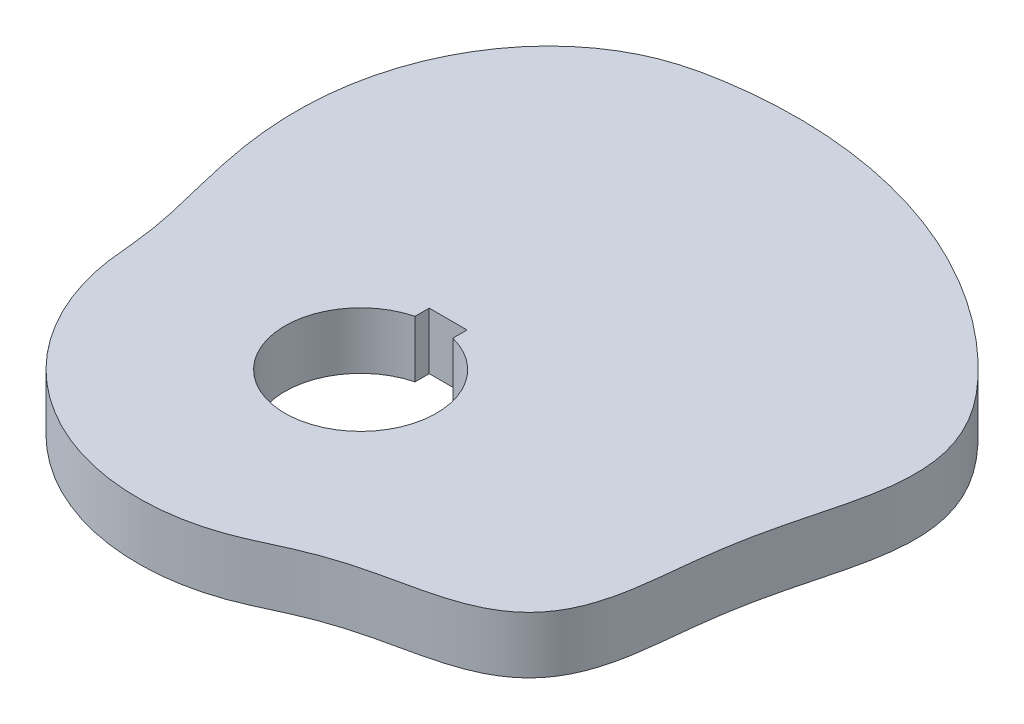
from build123d import *

# Parameters (mm, degrees)
SKETCH1_R                        = 177.8
SKETCH1_R_2                      = 25.4
DISC_CW_INSIDE_SWINGINGARM_DEPTH = 19.05
KEYWAY_0_5000_X_0_3750MM_DEPTH   = 253.167766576
SINGLE_SURFACE_SKETCH_R          = 177.8
SINGLE_SURFACE_DEPTH             = 20.6502


with BuildPart() as part:
    # Sketch1 → Disc_ CW_ Inside_ SwingingArm (new body)
    with BuildSketch(Plane(origin=(0, 0, 0), x_dir=(1, 0, 0), z_dir=(0, 1, 0))):
        with Locations(Location((0, 0, 0), (0, 0, 270))):
            Circle(SKETCH1_R)
        with Locations(Location((0, 0, 0), (0, 0, 270))):
            Circle(SKETCH1_R_2, mode=Mode.SUBTRACT)
    extrude(amount=-DISC_CW_INSIDE_SWINGINGARM_DEPTH)

    # Sketch7 → Keyway_ 0.5000 x 0.3750mm (cut, through all)
    with BuildSketch(Plane(origin=(0, 0, 0), x_dir=(1, 0, 0), z_dir=(0, 1, 0))):
        with BuildLine():
            Line((6.35, 24.593444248), (6.35, 29.355944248))
            Line((6.35, 29.355944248), (-6.35, 29.355944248))
            Line((-6.35, 29.355944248), (-6.35, 24.593444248))
            ThreePointArc((-6.35, 24.593444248), (0, -25.4), (6.35, 24.593444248))
        make_face()
    extrude(amount=-KEYWAY_0_5000_X_0_3750MM_DEPTH, mode=Mode.SUBTRACT)

    # Single Surface Sketch → Single Surface (cut)
    with BuildSketch(Plane(origin=(0, 0, 0), x_dir=(1, 0, 0), z_dir=(0, 1, 0))):
        Circle(SINGLE_SURFACE_SKETCH_R)
        with BuildLine():
            add(Edge.make_bspline(
                [(109.559698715, -17.138811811), (109.670945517, -16.427679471), (109.872598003, -15.051108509), (110.143805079, -12.990584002), (110.390757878, -10.94489769), (110.627231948, -8.85282623), (110.858890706, -6.717267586), (111.091589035, -4.541237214), (111.331217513, -2.327935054), (111.583527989, -0.080815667), (111.85394266, 2.196357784), (112.147354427, 4.499488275), (112.467929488, 6.824160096), (112.818926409, 9.165700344), (113.202547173, 11.519285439), (113.619834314, 13.880083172), (114.070623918, 16.243413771), (114.553557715, 18.604909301), (115.066150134, 20.960650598), (115.604899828, 23.307264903), (116.16543123, 25.641974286), (116.742650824, 27.962593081), (117.330904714, 30.26747994), (117.924127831, 32.555455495), (118.515979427, 34.825699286), (119.099963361, 37.077639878), (119.669534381, 39.310850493), (120.21819295, 41.524959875), (120.739571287, 43.71958518), (121.227512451, 45.894290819), (121.676143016, 48.048574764), (122.079938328, 50.181881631), (122.433777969, 52.293640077), (122.732988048, 54.383320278), (122.973366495, 56.450505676), (123.151187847, 58.494971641), (123.263185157, 60.5167624), (123.30650864, 62.516256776), (123.278663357, 64.49421329), (123.177431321, 66.451786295), (123.000786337, 68.390507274), (122.7468121, 70.312229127), (122.413634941, 72.219035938), (121.999381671, 74.113125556), (121.502170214, 75.996676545), (120.920136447, 77.871713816), (120.251495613, 79.739987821), (119.494631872, 81.602880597), (118.64820578, 83.461348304), (117.711267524, 85.315905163), (116.683363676, 87.166648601), (115.564626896, 89.013320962), (114.35584094, 90.855399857), (113.058476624, 92.692207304), (111.674698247, 94.523027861), (110.207341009, 96.347224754), (108.659869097, 98.164351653), (107.036298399, 99.974231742), (105.34117201, 101.777083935), (103.58041083, 103.572216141), (101.767548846, 105.353594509), (99.91466832, 107.112608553), (98.030056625, 108.840023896), (96.11561158, 110.534313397), (94.171881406, 112.194925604), (92.199467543, 113.821364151), (90.198968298, 115.413131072), (88.170993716, 116.969742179), (86.116161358, 118.490723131), (84.035097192, 119.975610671), (81.928435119, 121.423952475), (79.796816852, 122.835307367), (77.640891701, 124.209245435), (75.461316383, 125.545348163), (73.258754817, 126.843208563), (71.033877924, 128.102431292), (68.787363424, 129.322632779), (66.519895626, 130.50344134), (64.232165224, 131.644497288), (61.924869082, 132.745453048), (59.598710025, 133.805973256), (57.254396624, 134.825734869), (54.892642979, 135.804427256), (52.514168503, 136.7417523), (50.119697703, 137.637424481), (47.709959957, 138.49117097), (45.285689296, 139.302731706), (42.847624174, 140.071859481), (40.396507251, 140.79832001), (37.933085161, 141.481892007), (35.458108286, 142.122367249), (32.972330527, 142.719550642), (30.476509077, 143.273260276), (27.971404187, 143.783327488), (25.457778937, 144.249596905), (22.936399, 144.671926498), (20.408032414, 145.05018762), (17.873449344, 145.38426505), (15.333421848, 145.674057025), (12.788723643, 145.919475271), (10.240129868, 146.120445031), (7.688416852, 146.276905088), (5.134361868, 146.388807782), (2.578742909, 146.456119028), (0.022338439, 146.478818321), (-2.534072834, 146.456898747), (-5.089712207, 146.390366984), (-7.643801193, 146.27924329), (-10.195561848, 146.123561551), (-12.744216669, 145.923369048), (-15.288990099, 145.67872729), (-17.829104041, 145.389708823), (-20.279307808, 145.067518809), (-22.797558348, 144.693783), (-25.282232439, 144.28097168), (-27.799569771, 143.804871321), (-30.17828065, 143.294295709), (-32.505850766, 142.726979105), (-34.786796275, 142.096811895), (-37.026091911, 141.397982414), (-39.228907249, 140.625031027), (-41.400208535, 139.772696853), (-43.544901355, 138.836685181), (-45.66552443, 137.811466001), (-47.764431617, 136.697546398), (-49.839272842, 135.492553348), (-51.887057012, 134.197134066), (-53.904127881, 132.81181686), (-55.886830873, 131.33758377), (-57.831447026, 129.775684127), (-59.734248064, 128.127693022), (-61.591519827, 126.395499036), (-63.399595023, 124.581307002), (-65.154883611, 122.687632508), (-66.853903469, 120.717294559), (-68.493310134, 118.673404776), (-70.069925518, 116.559353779), (-71.580765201, 114.378794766), (-73.023064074, 112.135624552), (-74.394300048, 109.833962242), (-75.692215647, 107.478125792), (-76.914837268, 105.072606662), (-78.060491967, 102.622042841), (-79.12782163, 100.131190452), (-80.115794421, 97.604894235), (-81.023713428, 95.048057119), (-81.851222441, 92.46560919), (-82.598308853, 89.862476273), (-83.265303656, 87.24354841), (-83.852878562, 84.613648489), (-84.362040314, 81.977501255), (-84.794122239, 79.339702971), (-85.150773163, 76.704691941), (-85.433943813, 74.076720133), (-85.645870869, 71.459826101), (-85.789058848, 68.857809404), (-85.866260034, 66.274206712), (-85.880452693, 63.712269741), (-85.834817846, 61.174945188), (-85.732714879, 58.664856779), (-85.577656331, 56.184289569), (-85.373282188, 53.735176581), (-85.123334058, 51.31908792), (-84.831629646, 48.937222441), (-84.502037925, 46.590402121), (-84.138455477, 44.279069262), (-83.744784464, 42.003286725), (-83.324912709, 39.762741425), (-82.882696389, 37.556751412), (-82.421945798, 35.384276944), (-81.946414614, 33.243936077), (-81.459793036, 31.134025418), (-80.96570499, 29.052546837), (-80.467709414, 26.997241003), (-79.969305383, 24.965628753), (-79.473940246, 22.955061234), (-78.985020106, 20.962779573), (-78.505918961, 18.985984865), (-78.039991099, 17.021917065), (-77.590557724, 15.067946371), (-77.160960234, 13.121657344), (-76.754321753, 11.180985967), (-76.374322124, 9.244141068), (-76.022509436, 7.312321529), (-75.705537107, 5.390546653), (-75.423950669, 3.490016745), (-75.178344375, 1.624594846), (-74.966061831, -0.191206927), (-74.782210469, -1.94347786), (-74.620023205, -3.6197232), (-74.471732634, -5.20953816), (-74.329227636, -6.705008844), (-74.184947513, -8.105093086), (-74.027774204, -9.436269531), (-73.851009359, -10.730859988), (-73.652528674, -12.018109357), (-73.431553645, -13.301691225), (-73.188226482, -14.581223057), (-72.922601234, -15.856312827), (-72.634764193, -17.12657274), (-72.324801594, -18.391615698), (-71.992808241, -19.651056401), (-71.63888516, -20.904511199), (-71.263140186, -22.151598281), (-70.865687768, -23.391937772), (-70.446648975, -24.625151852), (-70.00615145, -25.850864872), (-69.544329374, -27.068703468), (-69.061323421, -28.278296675), (-68.55728072, -29.479276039), (-68.032354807, -30.67127573), (-67.48670558, -31.853932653), (-66.920499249, -33.02688656), (-66.333908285, -34.189780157), (-65.72711137, -35.342259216), (-65.10029334, -36.48397268), (-64.453645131, -37.614572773), (-63.787363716, -38.733715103), (-63.101652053, -39.841058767), (-62.396719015, -40.93626646), (-61.672779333, -42.019004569), (-60.930053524, -43.088943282), (-60.16876783, -44.145756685), (-59.389154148, -45.189122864), (-58.591449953, -46.218723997), (-57.775898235, -47.23424646), (-56.942747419, -48.235380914), (-56.09225129, -49.221822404), (-55.224668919, -50.193270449), (-54.340264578, -51.149429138), (-53.439307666, -52.090007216), (-52.522072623, -53.014718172), (-51.588838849, -53.923280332), (-50.639890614, -54.815416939), (-49.675516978, -55.690856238), (-48.696011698, -56.549331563), (-47.701673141, -57.390581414), (-46.692804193, -58.214349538), (-45.669712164, -59.020385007), (-44.632708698, -59.808442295), (-43.582109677, -60.578281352), (-42.518235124, -61.329667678), (-41.441409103, -62.062372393), (-40.351959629, -62.776172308), (-39.250218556, -63.470849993), (-38.136521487, -64.146193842), (-37.011207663, -64.801998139), (-35.874619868, -65.43806312), (-34.727104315, -66.054195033), (-33.56901055, -66.650206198), (-32.40069134, -67.225915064), (-31.222502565, -67.781146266), (-30.034803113, -68.315730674), (-28.837954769, -68.829505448), (-27.632322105, -69.322314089), (-26.418272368, -69.794006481), (-25.196175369, -70.244438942), (-23.966403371, -70.673474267), (-22.729330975, -71.080981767), (-21.485335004, -71.466837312), (-20.234794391, -71.830923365), (-18.978090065, -72.173129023), (-17.715604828, -72.493350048), (-16.447723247, -72.791488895), (-15.17483153, -73.06745475), (-13.897317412, -73.32116355), (-12.615570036, -73.552538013), (-11.329979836, -73.761507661), (-10.040938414, -73.948008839), (-8.748838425, -74.111984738), (-7.454073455, -74.253385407), (-6.157037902, -74.372167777), (-4.858126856, -74.468295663), (-3.557735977, -74.541739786), (-2.256261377, -74.592477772), (-0.954099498, -74.620494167), (0.348353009, -74.625780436), (1.650699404, -74.60833497), (2.95254298, -74.568163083), (4.253487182, -74.50527701), (5.553135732, -74.419695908), (6.851092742, -74.311445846), (8.146962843, -74.180559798), (9.440351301, -74.027077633), (10.730864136, -73.851046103), (12.018108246, -73.652518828), (13.301691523, -73.431556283), (14.581222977, -73.188225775), (15.856312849, -72.922601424), (17.126572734, -72.634764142), (18.3916157, -72.324801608), (19.651056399, -71.992808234), (20.904511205, -71.638885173), (22.151598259, -71.263140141), (23.391937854, -70.865687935), (24.625151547, -70.446648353), (25.85086601, -70.006153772), (27.068699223, -69.54432071), (28.28565659, -69.058423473), (29.518687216, -68.54050694), (30.786287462, -67.98684825), (32.099458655, -67.396970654), (33.458656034, -66.775326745), (34.864268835, -66.127010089), (36.316584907, -65.457595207), (37.815638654, -64.773067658), (39.361040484, -64.079707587), (40.951817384, -63.383940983), (42.586283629, -62.692150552), (44.261963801, -62.01045333), (45.975584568, -61.344458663), (47.723142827, -60.69902843), (49.500045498, -60.07806527), (51.301303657, -59.484353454), (53.121753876, -58.919470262), (54.956275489, -58.383775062), (56.799974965, -57.876471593), (58.648316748, -57.395729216), (60.497191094, -56.938843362), (62.342920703, -56.502414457), (64.182216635, -56.082527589), (66.012099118, -55.674920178), (67.829800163, -55.275130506), (69.632663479, -54.878624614), (71.418054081, -54.480902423), (73.183286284, -54.077585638), (74.925575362, -53.664490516), (76.642015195, -53.237688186), (78.32958208, -52.793554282), (79.98516328, -52.328808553), (81.605607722, -51.840544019), (83.187795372, -51.326244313), (84.728720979, -50.783787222), (86.225587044, -50.211432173), (87.675900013, -49.607789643), (89.07756277, -48.971771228), (90.428955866, -48.30252047), (91.728999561, -47.599326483), (92.977189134, -46.861524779), (94.173597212, -46.088392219), (95.318839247, -45.279045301), (96.414001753, -44.432352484), (97.460537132, -43.546871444), (98.460133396, -42.620820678), (99.414570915, -41.652091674), (100.325580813, -40.638303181), (101.194720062, -39.576893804), (102.023276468, -38.465244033), (102.81221294, -37.300814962), (103.562155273, -36.081289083), (104.273422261, -34.804698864), (104.946092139, -33.469531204), (105.580095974, -32.074799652), (106.175326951, -30.620080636), (106.731754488, -29.105514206), (107.249533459, -27.531773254), (107.72910096, -25.90000755), (108.17125539, -24.211770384), (108.577215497, -22.46893537), (108.948656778, -20.673612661), (109.276057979, -18.891609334), (109.47082751, -17.706910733), (109.559698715, -17.138811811)],
                knots=[0, 0, 0, 0, 0.003113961, 0.006018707, 0.008991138, 0.012028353, 0.015127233, 0.018284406, 0.021496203, 0.024758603, 0.028067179, 0.03141708, 0.034803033, 0.03821939, 0.041660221, 0.045119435, 0.04859093, 0.052068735, 0.055547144, 0.059020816, 0.062484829, 0.065934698, 0.069366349, 0.072776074, 0.076160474, 0.079516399, 0.08284091, 0.086131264, 0.089384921, 0.092599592, 0.095773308, 0.098904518, 0.101992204, 0.105036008, 0.108036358, 0.110994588, 0.113913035, 0.116795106, 0.119645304, 0.122469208, 0.125273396, 0.128065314, 0.130853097, 0.133645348, 0.136450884, 0.139278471, 0.142136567, 0.145033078, 0.147975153, 0.150969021, 0.15401988, 0.157131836, 0.160307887, 0.163549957, 0.166858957, 0.170234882, 0.173676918, 0.177183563, 0.180752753, 0.18438198, 0.188061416, 0.19174797, 0.195434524, 0.199121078, 0.202807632, 0.206494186, 0.21018074, 0.213867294, 0.217553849, 0.221240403, 0.224926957, 0.228613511, 0.232300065, 0.235986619, 0.239673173, 0.243359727, 0.247046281, 0.250732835, 0.254419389, 0.258105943, 0.261792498, 0.265479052, 0.269165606, 0.27285216, 0.276538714, 0.280225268, 0.283911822, 0.287598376, 0.29128493, 0.294971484, 0.298658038, 0.302344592, 0.306031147, 0.309717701, 0.313404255, 0.317090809, 0.320777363, 0.324463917, 0.328150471, 0.331837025, 0.335523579, 0.339210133, 0.342896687, 0.346583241, 0.350269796, 0.35395635, 0.357642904, 0.361329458, 0.365016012, 0.368702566, 0.37238912, 0.376075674, 0.379762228, 0.383080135, 0.387089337, 0.390658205, 0.394163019, 0.397613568, 0.401021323, 0.404399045, 0.407760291, 0.411118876, 0.414488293, 0.417881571, 0.421306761, 0.42476593, 0.428259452, 0.431787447, 0.435349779, 0.438946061, 0.442575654, 0.446237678, 0.449931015, 0.453654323, 0.457406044, 0.461184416, 0.464987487, 0.468813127, 0.472659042, 0.476522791, 0.4804018, 0.484293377, 0.48819473, 0.492102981, 0.496015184, 0.499928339, 0.503839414, 0.507745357, 0.511643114, 0.515529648, 0.519401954, 0.523257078, 0.527092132, 0.530904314, 0.534690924, 0.538449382, 0.542177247, 0.54587223, 0.549532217, 0.553155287, 0.556739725, 0.560284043, 0.563786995, 0.567247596, 0.570665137, 0.574039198, 0.577369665, 0.580656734, 0.583900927, 0.587103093, 0.590264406, 0.593386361, 0.596470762, 0.599519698, 0.602535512, 0.605520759, 0.608478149, 0.611410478, 0.61432055, 0.61721108, 0.620084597, 0.622943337, 0.625789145, 0.628623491, 0.631438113, 0.634215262, 0.636935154, 0.639577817, 0.642124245, 0.644557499, 0.646863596, 0.649032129, 0.651056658, 0.652952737, 0.654830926, 0.656709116, 0.658587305, 0.660465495, 0.662343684, 0.664221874, 0.666100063, 0.667978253, 0.669856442, 0.671734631, 0.673612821, 0.67549101, 0.6773692, 0.679247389, 0.681125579, 0.683003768, 0.684881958, 0.686760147, 0.688638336, 0.690516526, 0.692394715, 0.694272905, 0.696151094, 0.698029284, 0.699907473, 0.701785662, 0.703663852, 0.705542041, 0.707420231, 0.70929842, 0.71117661, 0.713054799, 0.714932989, 0.716811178, 0.718689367, 0.720567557, 0.722445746, 0.724323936, 0.726202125, 0.728080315, 0.729958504, 0.731836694, 0.733714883, 0.735593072, 0.737471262, 0.739349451, 0.741227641, 0.74310583, 0.74498402, 0.746862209, 0.748740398, 0.750618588, 0.752496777, 0.754374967, 0.756253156, 0.758131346, 0.760009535, 0.761887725, 0.763765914, 0.765644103, 0.767522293, 0.769400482, 0.771278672, 0.773156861, 0.775035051, 0.77691324, 0.778791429, 0.780669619, 0.782547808, 0.784425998, 0.786304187, 0.788182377, 0.790060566, 0.791938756, 0.793816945, 0.795695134, 0.797573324, 0.799451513, 0.801329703, 0.803207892, 0.805086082, 0.806964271, 0.808842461, 0.81072065, 0.812598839, 0.814477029, 0.816355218, 0.818233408, 0.820111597, 0.821989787, 0.823867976, 0.825746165, 0.827624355, 0.829502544, 0.831380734, 0.833258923, 0.835137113, 0.837015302, 0.838893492, 0.840771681, 0.84264987, 0.84452806, 0.846406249, 0.848284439, 0.850162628, 0.852075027, 0.854070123, 0.856146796, 0.858302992, 0.860536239, 0.862843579, 0.865221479, 0.867665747, 0.87017147, 0.872733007, 0.875344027, 0.877997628, 0.880686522, 0.883403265, 0.886140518, 0.888891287, 0.891649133, 0.894408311, 0.897163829, 0.899911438, 0.902647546, 0.905369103, 0.908073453, 0.910758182, 0.913420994, 0.916059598, 0.91867164, 0.921254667, 0.92380613, 0.926323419, 0.928803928, 0.931245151, 0.933644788, 0.936000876, 0.938311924, 0.940577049, 0.942796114, 0.944969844, 0.947099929, 0.949189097, 0.951241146, 0.953260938, 0.955254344, 0.957228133, 0.959189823, 0.961147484, 0.963109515, 0.965084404, 0.967080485, 0.969105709, 0.971167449, 0.973272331, 0.975426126, 0.977633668, 0.979898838, 0.982224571, 0.984612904, 0.98706505, 0.989581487, 0.992162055, 0.994806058, 0.997512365, 1, 1, 1, 1], degree=3))
        make_face(mode=Mode.SUBTRACT)
    extrude(amount=-SINGLE_SURFACE_DEPTH, mode=Mode.SUBTRACT)


solid = part.part
